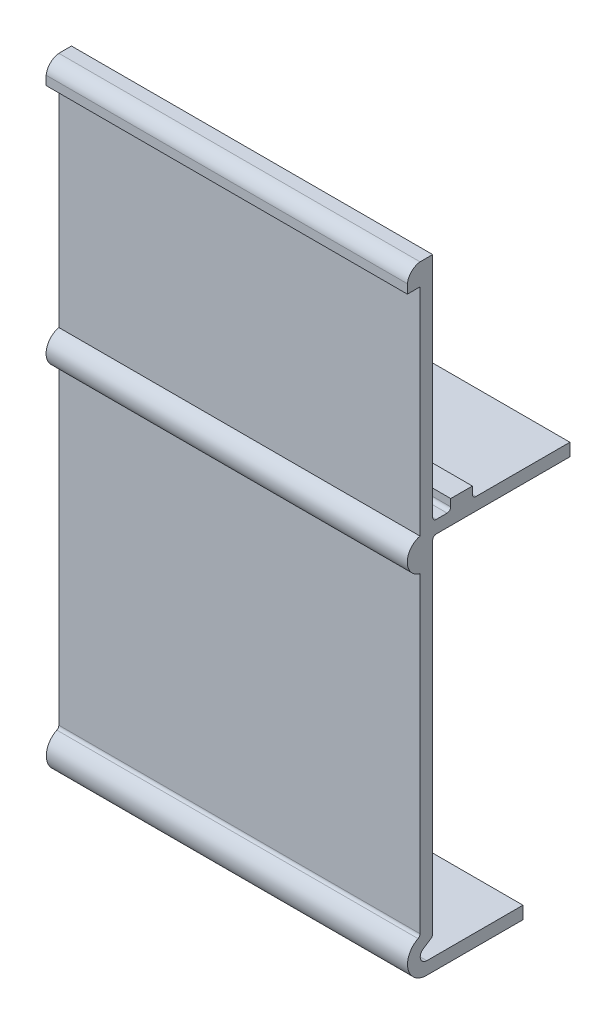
from build123d import *

# Parameters (mm, degrees)
EXTRUDE1_DEPTH = 50


with BuildPart() as part:
    # Sketch1 → Extrude1 (new, symmetric)
    with BuildSketch(Plane(origin=(0, 0, 0), x_dir=(0, 0, -1), z_dir=(1, 0, 0))):
        with BuildLine():
            Line((1.678571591, 103.500000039), (1.678571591, 9.079117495))
            ThreePointArc((1.678571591, 9.079117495), (1.556654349, 8.600608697), (1.220630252, 8.238776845))
            Line((1.220630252, 8.238776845), (-0.933256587, 6.849420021))
            ThreePointArc((-0.933256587, 6.849420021), (-1.692554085, 4.805774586), (0.053290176, 3.500000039))
            Line((0.053290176, 3.500000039), (26.678571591, 3.500000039))
            Line((26.678571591, 3.500000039), (26.678571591, 3.9e-08))
            Line((26.678571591, 3.9e-08), (1.62e-07, 3.9e-08))
            ThreePointArc((1.62e-07, 3.9e-08), (-5.141364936, 4.064814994), (-2.372437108, 10.005302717))
            ThreePointArc((-2.372437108, 10.005302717), (-1.970255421, 10.373953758), (-1.821428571, 10.898838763))
            Line((-1.821428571, 10.898838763), (-1.821428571, 97.25))
            ThreePointArc((-1.821428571, 97.25), (-5.350056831, 101.75), (-1.821428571, 106.25))
            Line((-1.821428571, 106.25), (-1.821428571, 166))
            Line((-1.821428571, 166), (-5.321428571, 166))
            Line((-5.321428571, 166), (-5.321428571, 168.5))
            ThreePointArc((-5.321428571, 168.5), (-4.177807, 170.856378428), (-1.821428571, 172))
            Line((-1.821428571, 172), (1.678571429, 172))
            Line((1.678571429, 172), (1.678571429, 109))
            ThreePointArc((1.678571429, 109), (1.971464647, 108.292893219), (2.678571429, 108))
            Line((2.678571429, 108), (5.678571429, 108))
            ThreePointArc((5.678571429, 108), (6.38567821, 108.292893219), (6.678571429, 109))
            Line((6.678571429, 109), (6.678571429, 111))
            Line((6.678571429, 111), (12.678571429, 111))
            Line((12.678571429, 111), (12.678571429, 109))
            ThreePointArc((12.678571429, 109), (12.971464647, 108.292893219), (13.678571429, 108))
            Line((13.678571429, 108), (39.678571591, 108))
            Line((39.678571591, 108), (39.678571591, 104.500000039))
            Line((39.678571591, 104.500000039), (2.678571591, 104.500000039))
            ThreePointArc((2.678571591, 104.500000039), (1.97146481, 104.20710682), (1.678571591, 103.500000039))
        make_face()
    extrude(amount=EXTRUDE1_DEPTH, both=True)


solid = part.part
